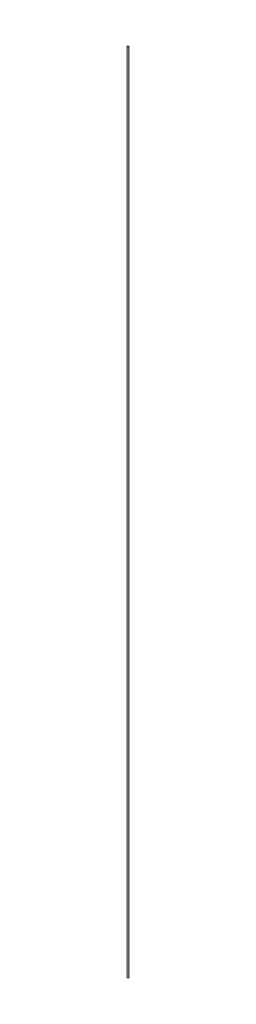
ISO-10303-21;
HEADER;
FILE_DESCRIPTION(('STEP AP214'),'2;1');
FILE_NAME('part.step','',(''),(''),'','','');
FILE_SCHEMA(('AUTOMOTIVE_DESIGN { 1 0 10303 214 1 1 1 1 }'));
ENDSEC;
DATA;
#1=APPLICATION_CONTEXT('core data for automotive mechanical design processes');
#2=APPLICATION_PROTOCOL_DEFINITION('international standard','automotive_design',2000,#1);
#3=PRODUCT_CONTEXT('',#1,'mechanical');
#4=PRODUCT('Part','Part','',(#3));
#5=PRODUCT_RELATED_PRODUCT_CATEGORY('part','',(#4));
#6=PRODUCT_DEFINITION_FORMATION('','',#4);
#7=PRODUCT_DEFINITION_CONTEXT('part definition',#1,'design');
#8=PRODUCT_DEFINITION('design','',#6,#7);
#9=PRODUCT_DEFINITION_SHAPE('','',#8);
#10=(LENGTH_UNIT() NAMED_UNIT(*) SI_UNIT(.MILLI.,.METRE.));
#11=(NAMED_UNIT(*) PLANE_ANGLE_UNIT() SI_UNIT($,.RADIAN.));
#12=(NAMED_UNIT(*) SI_UNIT($,.STERADIAN.) SOLID_ANGLE_UNIT());
#13=UNCERTAINTY_MEASURE_WITH_UNIT(LENGTH_MEASURE(1.E-05),#10,'distance_accuracy_value','');
#14=(GEOMETRIC_REPRESENTATION_CONTEXT(3) GLOBAL_UNCERTAINTY_ASSIGNED_CONTEXT((#13)) GLOBAL_UNIT_ASSIGNED_CONTEXT((#10,
#11,#12)) REPRESENTATION_CONTEXT('',''));
#15=CARTESIAN_POINT('',(0.,0.,0.));
#16=DIRECTION('',(0.,0.,1.));
#17=DIRECTION('',(1.,0.,0.));
#18=AXIS2_PLACEMENT_3D('',#15,#16,#17);
#19=CARTESIAN_POINT('',(0.,1480.,0.));
#20=DIRECTION('',(0.,-1.,0.));
#21=DIRECTION('',(0.,0.,-1.));
#22=AXIS2_PLACEMENT_3D('',#19,#20,#21);
#23=CYLINDRICAL_SURFACE('',#22,1.25);
#24=CARTESIAN_POINT('',(0.,1480.,0.));
#25=DIRECTION('',(0.,1.,0.));
#26=DIRECTION('',(0.,0.,1.));
#27=AXIS2_PLACEMENT_3D('',#24,#25,#26);
#28=CIRCLE('',#27,1.25);
#29=CARTESIAN_POINT('',(0.,1480.,1.25));
#30=VERTEX_POINT('',#29);
#31=EDGE_CURVE('E10',#30,#30,#28,.T.);
#32=ORIENTED_EDGE('',*,*,#31,.F.);
#33=EDGE_LOOP('',(#32));
#34=FACE_BOUND('',#33,.T.);
#35=CARTESIAN_POINT('',(0.,0.,0.));
#36=DIRECTION('',(0.,1.,0.));
#37=DIRECTION('',(0.,0.,1.));
#38=AXIS2_PLACEMENT_3D('',#35,#36,#37);
#39=CIRCLE('',#38,1.25);
#40=CARTESIAN_POINT('',(0.,0.,1.25));
#41=VERTEX_POINT('',#40);
#42=EDGE_CURVE('E33',#41,#41,#39,.T.);
#43=ORIENTED_EDGE('',*,*,#42,.T.);
#44=EDGE_LOOP('',(#43));
#45=FACE_BOUND('',#44,.T.);
#46=ADVANCED_FACE('F30',(#34,#45),#23,.T.);
#47=CARTESIAN_POINT('',(0.,1480.,0.));
#48=DIRECTION('',(0.,1.,0.));
#49=DIRECTION('',(0.,0.,1.));
#50=AXIS2_PLACEMENT_3D('',#47,#48,#49);
#51=PLANE('',#50);
#52=ORIENTED_EDGE('',*,*,#31,.T.);
#53=EDGE_LOOP('',(#52));
#54=FACE_BOUND('',#53,.T.);
#55=ADVANCED_FACE('F45',(#54),#51,.T.);
#56=CARTESIAN_POINT('',(0.,0.,0.));
#57=DIRECTION('',(0.,1.,0.));
#58=DIRECTION('',(0.,0.,1.));
#59=AXIS2_PLACEMENT_3D('',#56,#57,#58);
#60=PLANE('',#59);
#61=ORIENTED_EDGE('',*,*,#42,.F.);
#62=EDGE_LOOP('',(#61));
#63=FACE_BOUND('',#62,.T.);
#64=ADVANCED_FACE('F43',(#63),#60,.F.);
#65=CLOSED_SHELL('',(#46,#55,#64));
#66=MANIFOLD_SOLID_BREP('B2',#65);
#67=ADVANCED_BREP_SHAPE_REPRESENTATION('',(#18,#66),#14);
#68=SHAPE_DEFINITION_REPRESENTATION(#9,#67);
ENDSEC;
END-ISO-10303-21;
